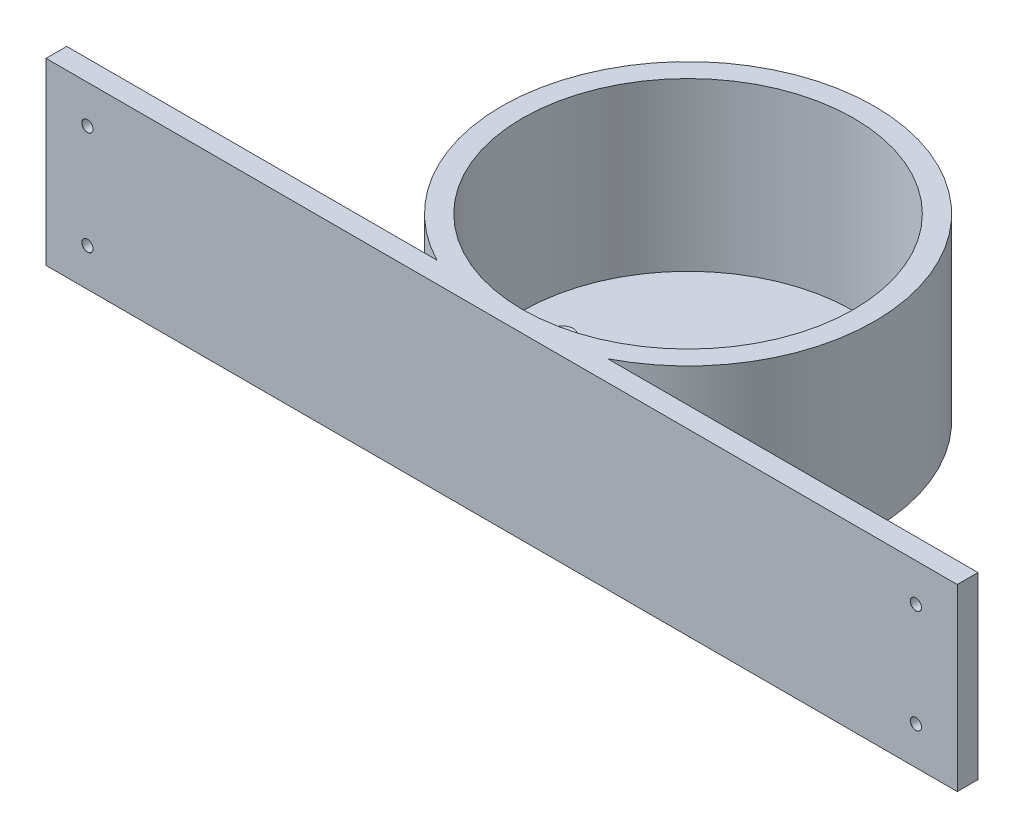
ISO-10303-21;
HEADER;
FILE_DESCRIPTION(('STEP AP214'),'2;1');
FILE_NAME('part.step','',(''),(''),'','','');
FILE_SCHEMA(('AUTOMOTIVE_DESIGN { 1 0 10303 214 1 1 1 1 }'));
ENDSEC;
DATA;
#1=APPLICATION_CONTEXT('core data for automotive mechanical design processes');
#2=APPLICATION_PROTOCOL_DEFINITION('international standard','automotive_design',2000,#1);
#3=PRODUCT_CONTEXT('',#1,'mechanical');
#4=PRODUCT('Part','Part','',(#3));
#5=PRODUCT_RELATED_PRODUCT_CATEGORY('part','',(#4));
#6=PRODUCT_DEFINITION_FORMATION('','',#4);
#7=PRODUCT_DEFINITION_CONTEXT('part definition',#1,'design');
#8=PRODUCT_DEFINITION('design','',#6,#7);
#9=PRODUCT_DEFINITION_SHAPE('','',#8);
#10=(LENGTH_UNIT() NAMED_UNIT(*) SI_UNIT(.MILLI.,.METRE.));
#11=(NAMED_UNIT(*) PLANE_ANGLE_UNIT() SI_UNIT($,.RADIAN.));
#12=(NAMED_UNIT(*) SI_UNIT($,.STERADIAN.) SOLID_ANGLE_UNIT());
#13=UNCERTAINTY_MEASURE_WITH_UNIT(LENGTH_MEASURE(1.E-05),#10,'distance_accuracy_value','');
#14=(GEOMETRIC_REPRESENTATION_CONTEXT(3) GLOBAL_UNCERTAINTY_ASSIGNED_CONTEXT((#13)) GLOBAL_UNIT_ASSIGNED_CONTEXT((#10,
#11,#12)) REPRESENTATION_CONTEXT('',''));
#15=CARTESIAN_POINT('',(0.,0.,0.));
#16=DIRECTION('',(0.,0.,1.));
#17=DIRECTION('',(1.,0.,0.));
#18=AXIS2_PLACEMENT_3D('',#15,#16,#17);
#19=CARTESIAN_POINT('',(0.,3.81,0.));
#20=DIRECTION('',(0.,-1.,0.));
#21=DIRECTION('',(0.,0.,-1.));
#22=AXIS2_PLACEMENT_3D('',#19,#20,#21);
#23=CYLINDRICAL_SURFACE('',#22,57.15);
#24=CARTESIAN_POINT('',(0.,54.991,0.));
#25=DIRECTION('',(0.,1.,0.));
#26=DIRECTION('',(0.,0.,1.));
#27=AXIS2_PLACEMENT_3D('',#24,#25,#26);
#28=CIRCLE('',#27,57.15);
#29=CARTESIAN_POINT('',(26.1817207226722,54.991,50.8));
#30=VERTEX_POINT('',#29);
#31=CARTESIAN_POINT('',(-26.1817207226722,54.991,50.8));
#32=VERTEX_POINT('',#31);
#33=EDGE_CURVE('E214',#30,#32,#28,.T.);
#34=ORIENTED_EDGE('',*,*,#33,.F.);
#35=DIRECTION('',(0.,-1.,0.));
#36=VECTOR('',#35,1.);
#37=CARTESIAN_POINT('',(26.1817207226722,3.81,50.8));
#38=LINE('',#37,#36);
#39=CARTESIAN_POINT('',(26.1817207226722,0.,50.8));
#40=VERTEX_POINT('',#39);
#41=EDGE_CURVE('E162',#30,#40,#38,.T.);
#42=ORIENTED_EDGE('',*,*,#41,.T.);
#43=CARTESIAN_POINT('',(0.,0.,0.));
#44=DIRECTION('',(0.,1.,0.));
#45=DIRECTION('',(0.,0.,1.));
#46=AXIS2_PLACEMENT_3D('',#43,#44,#45);
#47=CIRCLE('',#46,57.15);
#48=CARTESIAN_POINT('',(-26.1817207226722,0.,50.8));
#49=VERTEX_POINT('',#48);
#50=EDGE_CURVE('E217',#40,#49,#47,.T.);
#51=ORIENTED_EDGE('',*,*,#50,.T.);
#52=DIRECTION('',(0.,-1.,0.));
#53=VECTOR('',#52,1.);
#54=CARTESIAN_POINT('',(-26.1817207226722,3.81,50.8));
#55=LINE('',#54,#53);
#56=EDGE_CURVE('E157',#49,#32,#55,.F.);
#57=ORIENTED_EDGE('',*,*,#56,.T.);
#58=EDGE_LOOP('',(#34,#42,#51,#57));
#59=FACE_BOUND('',#58,.T.);
#60=ADVANCED_FACE('F39',(#59),#23,.T.);
#61=CARTESIAN_POINT('',(0.,0.,0.));
#62=DIRECTION('',(0.,1.,0.));
#63=DIRECTION('',(0.,0.,1.));
#64=AXIS2_PLACEMENT_3D('',#61,#62,#63);
#65=PLANE('',#64);
#66=CARTESIAN_POINT('',(38.354,0.,0.));
#67=DIRECTION('',(0.,1.,0.));
#68=DIRECTION('',(0.,0.,1.));
#69=AXIS2_PLACEMENT_3D('',#66,#67,#68);
#70=CIRCLE('',#69,1.725);
#71=CARTESIAN_POINT('',(38.354,0.,1.72499999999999));
#72=VERTEX_POINT('',#71);
#73=EDGE_CURVE('E165',#72,#72,#70,.T.);
#74=ORIENTED_EDGE('',*,*,#73,.T.);
#75=EDGE_LOOP('',(#74));
#76=FACE_BOUND('',#75,.T.);
#77=CARTESIAN_POINT('',(-38.354,0.,0.));
#78=DIRECTION('',(0.,1.,0.));
#79=DIRECTION('',(0.,0.,1.));
#80=AXIS2_PLACEMENT_3D('',#77,#78,#79);
#81=CIRCLE('',#80,1.725);
#82=CARTESIAN_POINT('',(-38.354,0.,1.725));
#83=VERTEX_POINT('',#82);
#84=EDGE_CURVE('E177',#83,#83,#81,.T.);
#85=ORIENTED_EDGE('',*,*,#84,.T.);
#86=EDGE_LOOP('',(#85));
#87=FACE_BOUND('',#86,.T.);
#88=DIRECTION('',(1.,0.,0.));
#89=VECTOR('',#88,1.);
#90=CARTESIAN_POINT('',(0.,0.,5.588));
#91=LINE('',#90,#89);
#92=CARTESIAN_POINT('',(-6.604,0.,5.588));
#93=VERTEX_POINT('',#92);
#94=CARTESIAN_POINT('',(6.604,0.,5.588));
#95=VERTEX_POINT('',#94);
#96=EDGE_CURVE('E192',#93,#95,#91,.T.);
#97=ORIENTED_EDGE('',*,*,#96,.T.);
#98=DIRECTION('',(0.,0.,-1.));
#99=VECTOR('',#98,1.);
#100=CARTESIAN_POINT('',(6.604,0.,0.));
#101=LINE('',#100,#99);
#102=CARTESIAN_POINT('',(6.604,0.,-5.588));
#103=VERTEX_POINT('',#102);
#104=EDGE_CURVE('E208',#95,#103,#101,.T.);
#105=ORIENTED_EDGE('',*,*,#104,.T.);
#106=DIRECTION('',(-1.,0.,0.));
#107=VECTOR('',#106,1.);
#108=CARTESIAN_POINT('',(0.,0.,-5.588));
#109=LINE('',#108,#107);
#110=CARTESIAN_POINT('',(-6.604,0.,-5.588));
#111=VERTEX_POINT('',#110);
#112=EDGE_CURVE('E205',#103,#111,#109,.T.);
#113=ORIENTED_EDGE('',*,*,#112,.T.);
#114=DIRECTION('',(0.,0.,1.));
#115=VECTOR('',#114,1.);
#116=CARTESIAN_POINT('',(-6.604,0.,0.));
#117=LINE('',#116,#115);
#118=EDGE_CURVE('E202',#111,#93,#117,.T.);
#119=ORIENTED_EDGE('',*,*,#118,.T.);
#120=EDGE_LOOP('',(#97,#105,#113,#119));
#121=FACE_BOUND('',#120,.T.);
#122=ORIENTED_EDGE('',*,*,#50,.F.);
#123=DIRECTION('',(-1.,0.,0.));
#124=VECTOR('',#123,1.);
#125=CARTESIAN_POINT('',(139.7,0.,50.8));
#126=LINE('',#125,#124);
#127=CARTESIAN_POINT('',(139.7,0.,50.8));
#128=VERTEX_POINT('',#127);
#129=EDGE_CURVE('E121',#128,#40,#126,.T.);
#130=ORIENTED_EDGE('',*,*,#129,.F.);
#131=DIRECTION('',(0.,0.,-1.));
#132=VECTOR('',#131,1.);
#133=CARTESIAN_POINT('',(139.7,0.,57.15));
#134=LINE('',#133,#132);
#135=CARTESIAN_POINT('',(139.7,0.,57.15));
#136=VERTEX_POINT('',#135);
#137=EDGE_CURVE('E114',#136,#128,#134,.T.);
#138=ORIENTED_EDGE('',*,*,#137,.F.);
#139=DIRECTION('',(-1.,0.,0.));
#140=VECTOR('',#139,1.);
#141=CARTESIAN_POINT('',(139.7,0.,57.15));
#142=LINE('',#141,#140);
#143=CARTESIAN_POINT('',(-139.7,0.,57.15));
#144=VERTEX_POINT('',#143);
#145=EDGE_CURVE('E119',#136,#144,#142,.T.);
#146=ORIENTED_EDGE('',*,*,#145,.T.);
#147=DIRECTION('',(0.,0.,-1.));
#148=VECTOR('',#147,1.);
#149=CARTESIAN_POINT('',(-139.7,0.,57.15));
#150=LINE('',#149,#148);
#151=CARTESIAN_POINT('',(-139.7,0.,50.8));
#152=VERTEX_POINT('',#151);
#153=EDGE_CURVE('E126',#144,#152,#150,.T.);
#154=ORIENTED_EDGE('',*,*,#153,.T.);
#155=EDGE_CURVE('E152',#49,#152,#126,.T.);
#156=ORIENTED_EDGE('',*,*,#155,.F.);
#157=EDGE_LOOP('',(#122,#130,#138,#146,#154,#156));
#158=FACE_BOUND('',#157,.T.);
#159=ADVANCED_FACE('F117',(#76,#87,#121,#158),#65,.F.);
#160=CARTESIAN_POINT('',(0.,54.991,0.));
#161=DIRECTION('',(0.,1.,0.));
#162=DIRECTION('',(0.,0.,1.));
#163=AXIS2_PLACEMENT_3D('',#160,#161,#162);
#164=PLANE('',#163);
#165=CARTESIAN_POINT('',(0.,54.991,0.));
#166=DIRECTION('',(0.,1.,0.));
#167=DIRECTION('',(0.,0.,1.));
#168=AXIS2_PLACEMENT_3D('',#165,#166,#167);
#169=CIRCLE('',#168,50.8);
#170=CARTESIAN_POINT('',(0.,54.991,-50.8));
#171=VERTEX_POINT('',#170);
#172=EDGE_CURVE('E211',#171,#171,#169,.T.);
#173=ORIENTED_EDGE('',*,*,#172,.F.);
#174=EDGE_LOOP('',(#173));
#175=FACE_BOUND('',#174,.T.);
#176=DIRECTION('',(0.,0.,-1.));
#177=VECTOR('',#176,1.);
#178=CARTESIAN_POINT('',(-139.7,54.991,57.15));
#179=LINE('',#178,#177);
#180=CARTESIAN_POINT('',(-139.7,54.991,57.15));
#181=VERTEX_POINT('',#180);
#182=CARTESIAN_POINT('',(-139.7,54.991,50.8));
#183=VERTEX_POINT('',#182);
#184=EDGE_CURVE('E158',#181,#183,#179,.T.);
#185=ORIENTED_EDGE('',*,*,#184,.F.);
#186=DIRECTION('',(1.,0.,0.));
#187=VECTOR('',#186,1.);
#188=CARTESIAN_POINT('',(-139.7,54.991,57.15));
#189=LINE('',#188,#187);
#190=CARTESIAN_POINT('',(139.7,54.991,57.15));
#191=VERTEX_POINT('',#190);
#192=EDGE_CURVE('E127',#181,#191,#189,.T.);
#193=ORIENTED_EDGE('',*,*,#192,.T.);
#194=DIRECTION('',(0.,0.,-1.));
#195=VECTOR('',#194,1.);
#196=CARTESIAN_POINT('',(139.7,54.991,57.15));
#197=LINE('',#196,#195);
#198=CARTESIAN_POINT('',(139.7,54.991,50.8));
#199=VERTEX_POINT('',#198);
#200=EDGE_CURVE('E140',#191,#199,#197,.T.);
#201=ORIENTED_EDGE('',*,*,#200,.T.);
#202=DIRECTION('',(1.,0.,0.));
#203=VECTOR('',#202,1.);
#204=CARTESIAN_POINT('',(-139.7,54.991,50.8));
#205=LINE('',#204,#203);
#206=EDGE_CURVE('E142',#30,#199,#205,.T.);
#207=ORIENTED_EDGE('',*,*,#206,.F.);
#208=ORIENTED_EDGE('',*,*,#33,.T.);
#209=EDGE_CURVE('E53',#183,#32,#205,.T.);
#210=ORIENTED_EDGE('',*,*,#209,.F.);
#211=EDGE_LOOP('',(#185,#193,#201,#207,#208,#210));
#212=FACE_BOUND('',#211,.T.);
#213=ADVANCED_FACE('F245',(#175,#212),#164,.T.);
#214=CARTESIAN_POINT('',(0.,54.991,0.));
#215=DIRECTION('',(0.,-1.,0.));
#216=DIRECTION('',(0.,0.,-1.));
#217=AXIS2_PLACEMENT_3D('',#214,#215,#216);
#218=CYLINDRICAL_SURFACE('',#217,50.8);
#219=CARTESIAN_POINT('',(0.,3.81,0.));
#220=DIRECTION('',(0.,1.,0.));
#221=DIRECTION('',(0.,0.,1.));
#222=AXIS2_PLACEMENT_3D('',#219,#220,#221);
#223=CIRCLE('',#222,50.8);
#224=CARTESIAN_POINT('',(0.,3.80999999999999,-50.8));
#225=VERTEX_POINT('',#224);
#226=EDGE_CURVE('E220',#225,#225,#223,.F.);
#227=CARTESIAN_POINT('',(0.,3.80999999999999,-50.8));
#228=CARTESIAN_POINT('',(0.,4.34313541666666,-50.8));
#229=CARTESIAN_POINT('',(0.,4.87627083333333,-50.8));
#230=CARTESIAN_POINT('',(0.,5.94254166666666,-50.8));
#231=CARTESIAN_POINT('',(0.,6.47567708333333,-50.8));
#232=CARTESIAN_POINT('',(0.,7.54194791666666,-50.8));
#233=CARTESIAN_POINT('',(0.,8.07508333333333,-50.8));
#234=CARTESIAN_POINT('',(0.,9.14135416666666,-50.8));
#235=CARTESIAN_POINT('',(0.,9.67448958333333,-50.8));
#236=CARTESIAN_POINT('',(0.,10.7407604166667,-50.8));
#237=CARTESIAN_POINT('',(0.,11.2738958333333,-50.8));
#238=CARTESIAN_POINT('',(0.,12.3401666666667,-50.8));
#239=CARTESIAN_POINT('',(0.,12.8733020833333,-50.8));
#240=CARTESIAN_POINT('',(0.,13.9395729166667,-50.8));
#241=CARTESIAN_POINT('',(0.,14.4727083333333,-50.8));
#242=CARTESIAN_POINT('',(0.,15.5389791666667,-50.8));
#243=CARTESIAN_POINT('',(0.,16.0721145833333,-50.8));
#244=CARTESIAN_POINT('',(0.,17.1383854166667,-50.8));
#245=CARTESIAN_POINT('',(0.,17.6715208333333,-50.8));
#246=CARTESIAN_POINT('',(0.,18.7377916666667,-50.8));
#247=CARTESIAN_POINT('',(0.,19.2709270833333,-50.8));
#248=CARTESIAN_POINT('',(0.,20.3371979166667,-50.8));
#249=CARTESIAN_POINT('',(0.,20.8703333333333,-50.8));
#250=CARTESIAN_POINT('',(0.,21.9366041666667,-50.8));
#251=CARTESIAN_POINT('',(0.,22.4697395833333,-50.8));
#252=CARTESIAN_POINT('',(0.,23.5360104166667,-50.8));
#253=CARTESIAN_POINT('',(0.,24.0691458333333,-50.8));
#254=CARTESIAN_POINT('',(0.,25.1354166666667,-50.8));
#255=CARTESIAN_POINT('',(0.,25.6685520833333,-50.8));
#256=CARTESIAN_POINT('',(0.,26.7348229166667,-50.8));
#257=CARTESIAN_POINT('',(0.,27.2679583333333,-50.8));
#258=CARTESIAN_POINT('',(0.,28.3342291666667,-50.8));
#259=CARTESIAN_POINT('',(0.,28.8673645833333,-50.8));
#260=CARTESIAN_POINT('',(0.,29.9336354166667,-50.8));
#261=CARTESIAN_POINT('',(0.,30.4667708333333,-50.8));
#262=CARTESIAN_POINT('',(0.,31.5330416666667,-50.8));
#263=CARTESIAN_POINT('',(0.,32.0661770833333,-50.8));
#264=CARTESIAN_POINT('',(0.,33.1324479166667,-50.8));
#265=CARTESIAN_POINT('',(0.,33.6655833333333,-50.8));
#266=CARTESIAN_POINT('',(0.,34.7318541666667,-50.8));
#267=CARTESIAN_POINT('',(0.,35.2649895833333,-50.8));
#268=CARTESIAN_POINT('',(0.,36.3312604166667,-50.8));
#269=CARTESIAN_POINT('',(0.,36.8643958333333,-50.8));
#270=CARTESIAN_POINT('',(0.,37.9306666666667,-50.8));
#271=CARTESIAN_POINT('',(0.,38.4638020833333,-50.8));
#272=CARTESIAN_POINT('',(0.,39.5300729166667,-50.8));
#273=CARTESIAN_POINT('',(0.,40.0632083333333,-50.8));
#274=CARTESIAN_POINT('',(0.,41.1294791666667,-50.8));
#275=CARTESIAN_POINT('',(0.,41.6626145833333,-50.8));
#276=CARTESIAN_POINT('',(0.,42.7288854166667,-50.8));
#277=CARTESIAN_POINT('',(0.,43.2620208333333,-50.8));
#278=CARTESIAN_POINT('',(0.,44.3282916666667,-50.8));
#279=CARTESIAN_POINT('',(0.,44.8614270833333,-50.8));
#280=CARTESIAN_POINT('',(0.,45.9276979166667,-50.8));
#281=CARTESIAN_POINT('',(0.,46.4608333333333,-50.8));
#282=CARTESIAN_POINT('',(0.,47.5271041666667,-50.8));
#283=CARTESIAN_POINT('',(0.,48.0602395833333,-50.8));
#284=CARTESIAN_POINT('',(0.,49.1265104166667,-50.8));
#285=CARTESIAN_POINT('',(0.,49.6596458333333,-50.8));
#286=CARTESIAN_POINT('',(0.,50.7259166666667,-50.8));
#287=CARTESIAN_POINT('',(0.,51.2590520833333,-50.8));
#288=CARTESIAN_POINT('',(0.,52.3253229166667,-50.8));
#289=CARTESIAN_POINT('',(0.,52.8584583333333,-50.8));
#290=CARTESIAN_POINT('',(0.,53.9247291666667,-50.8));
#291=CARTESIAN_POINT('',(0.,54.4578645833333,-50.8));
#292=CARTESIAN_POINT('',(0.,54.991,-50.8));
#293=B_SPLINE_CURVE_WITH_KNOTS('',3,(#227,#228,#229,#230,#231,#232,#233,#234,#235,#236,#237,
#238,#239,#240,#241,#242,#243,#244,#245,#246,#247,#248,#249,#250,#251,#252,#253,#254,#255,#256,
#257,#258,#259,#260,#261,#262,#263,#264,#265,#266,#267,#268,#269,#270,#271,#272,#273,#274,#275,
#276,#277,#278,#279,#280,#281,#282,#283,#284,#285,#286,#287,#288,#289,#290,#291,#292),
.UNSPECIFIED.,.F.,.F.,(4,2,2,2,2,2,2,2,2,2,2,2,2,2,2,2,2,2,2,2,2,2,2,2,2,2,2,2,2,2,2,2,4),(0.,
1.59940625,3.1988125,4.79821875,6.397625,7.99703125,9.5964375,11.19584375,12.79525,14.39465625,
15.9940625,17.59346875,19.192875,20.79228125,22.3916875,23.99109375,25.5905,27.18990625,
28.7893125,30.38871875,31.988125,33.58753125,35.1869375,36.78634375,38.38575,39.98515625,
41.5845625,43.18396875,44.783375,46.38278125,47.9821875,49.58159375,51.181),.UNSPECIFIED.);
#294=EDGE_CURVE('BSEAM251',#225,#171,#293,.T.);
#295=ORIENTED_EDGE('',*,*,#226,.T.);
#296=ORIENTED_EDGE('',*,*,#172,.T.);
#297=ORIENTED_EDGE('',*,*,#294,.T.);
#298=ORIENTED_EDGE('',*,*,#294,.F.);
#299=EDGE_LOOP('',(#295,#297,#296,#298));
#300=FACE_BOUND('',#299,.T.);
#301=ADVANCED_FACE('F251',(#300),#218,.F.);
#302=CARTESIAN_POINT('',(0.,3.81,0.));
#303=DIRECTION('',(0.,1.,0.));
#304=DIRECTION('',(0.,0.,1.));
#305=AXIS2_PLACEMENT_3D('',#302,#303,#304);
#306=PLANE('',#305);
#307=CARTESIAN_POINT('',(38.354,3.81,0.));
#308=DIRECTION('',(0.,1.,0.));
#309=DIRECTION('',(0.,0.,1.));
#310=AXIS2_PLACEMENT_3D('',#307,#308,#309);
#311=CIRCLE('',#310,3.15);
#312=CARTESIAN_POINT('',(38.354,3.81,3.14999999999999));
#313=VERTEX_POINT('',#312);
#314=EDGE_CURVE('E168',#313,#313,#311,.T.);
#315=ORIENTED_EDGE('',*,*,#314,.F.);
#316=EDGE_LOOP('',(#315));
#317=FACE_BOUND('',#316,.T.);
#318=CARTESIAN_POINT('',(-38.354,3.81,0.));
#319=DIRECTION('',(0.,1.,0.));
#320=DIRECTION('',(0.,0.,1.));
#321=AXIS2_PLACEMENT_3D('',#318,#319,#320);
#322=CIRCLE('',#321,3.15);
#323=CARTESIAN_POINT('',(-38.354,3.81,3.15));
#324=VERTEX_POINT('',#323);
#325=EDGE_CURVE('E180',#324,#324,#322,.T.);
#326=ORIENTED_EDGE('',*,*,#325,.F.);
#327=EDGE_LOOP('',(#326));
#328=FACE_BOUND('',#327,.T.);
#329=DIRECTION('',(0.,0.,-1.));
#330=VECTOR('',#329,1.);
#331=CARTESIAN_POINT('',(6.604,3.81,0.));
#332=LINE('',#331,#330);
#333=CARTESIAN_POINT('',(6.604,3.81,5.588));
#334=VERTEX_POINT('',#333);
#335=CARTESIAN_POINT('',(6.604,3.81,-5.588));
#336=VERTEX_POINT('',#335);
#337=EDGE_CURVE('E11',#334,#336,#332,.T.);
#338=ORIENTED_EDGE('',*,*,#337,.F.);
#339=DIRECTION('',(1.,0.,0.));
#340=VECTOR('',#339,1.);
#341=CARTESIAN_POINT('',(0.,3.81,5.588));
#342=LINE('',#341,#340);
#343=CARTESIAN_POINT('',(-6.604,3.81,5.588));
#344=VERTEX_POINT('',#343);
#345=EDGE_CURVE('E223',#344,#334,#342,.T.);
#346=ORIENTED_EDGE('',*,*,#345,.F.);
#347=DIRECTION('',(0.,0.,1.));
#348=VECTOR('',#347,1.);
#349=CARTESIAN_POINT('',(-6.604,3.81,0.));
#350=LINE('',#349,#348);
#351=CARTESIAN_POINT('',(-6.604,3.81,-5.588));
#352=VERTEX_POINT('',#351);
#353=EDGE_CURVE('E225',#352,#344,#350,.T.);
#354=ORIENTED_EDGE('',*,*,#353,.F.);
#355=DIRECTION('',(-1.,0.,0.));
#356=VECTOR('',#355,1.);
#357=CARTESIAN_POINT('',(0.,3.81,-5.588));
#358=LINE('',#357,#356);
#359=EDGE_CURVE('E46',#336,#352,#358,.T.);
#360=ORIENTED_EDGE('',*,*,#359,.F.);
#361=EDGE_LOOP('',(#338,#346,#354,#360));
#362=FACE_BOUND('',#361,.T.);
#363=ORIENTED_EDGE('',*,*,#226,.F.);
#364=EDGE_LOOP('',(#363));
#365=FACE_BOUND('',#364,.T.);
#366=ADVANCED_FACE('F238',(#317,#328,#362,#365),#306,.T.);
#367=CARTESIAN_POINT('',(6.604,54.991,5.588));
#368=DIRECTION('',(1.,0.,0.));
#369=DIRECTION('',(0.,0.,-1.));
#370=AXIS2_PLACEMENT_3D('',#367,#368,#369);
#371=PLANE('',#370);
#372=DIRECTION('',(0.,-1.,0.));
#373=VECTOR('',#372,1.);
#374=CARTESIAN_POINT('',(6.604,54.991,5.588));
#375=LINE('',#374,#373);
#376=EDGE_CURVE('E61',#334,#95,#375,.T.);
#377=ORIENTED_EDGE('',*,*,#376,.F.);
#378=ORIENTED_EDGE('',*,*,#337,.T.);
#379=DIRECTION('',(0.,-1.,0.));
#380=VECTOR('',#379,1.);
#381=CARTESIAN_POINT('',(6.604,54.991,-5.588));
#382=LINE('',#381,#380);
#383=EDGE_CURVE('E189',#336,#103,#382,.T.);
#384=ORIENTED_EDGE('',*,*,#383,.T.);
#385=ORIENTED_EDGE('',*,*,#104,.F.);
#386=EDGE_LOOP('',(#377,#378,#384,#385));
#387=FACE_BOUND('',#386,.T.);
#388=ADVANCED_FACE('F242',(#387),#371,.F.);
#389=CARTESIAN_POINT('',(-6.604,54.991,-5.588));
#390=DIRECTION('',(0.,0.,-1.));
#391=DIRECTION('',(-1.,0.,0.));
#392=AXIS2_PLACEMENT_3D('',#389,#390,#391);
#393=PLANE('',#392);
#394=ORIENTED_EDGE('',*,*,#383,.F.);
#395=ORIENTED_EDGE('',*,*,#359,.T.);
#396=DIRECTION('',(0.,-1.,0.));
#397=VECTOR('',#396,1.);
#398=CARTESIAN_POINT('',(-6.604,54.991,-5.588));
#399=LINE('',#398,#397);
#400=EDGE_CURVE('E193',#352,#111,#399,.T.);
#401=ORIENTED_EDGE('',*,*,#400,.T.);
#402=ORIENTED_EDGE('',*,*,#112,.F.);
#403=EDGE_LOOP('',(#394,#395,#401,#402));
#404=FACE_BOUND('',#403,.T.);
#405=ADVANCED_FACE('F231',(#404),#393,.F.);
#406=CARTESIAN_POINT('',(-6.604,54.991,5.588));
#407=DIRECTION('',(-1.,0.,0.));
#408=DIRECTION('',(0.,0.,1.));
#409=AXIS2_PLACEMENT_3D('',#406,#407,#408);
#410=PLANE('',#409);
#411=ORIENTED_EDGE('',*,*,#400,.F.);
#412=ORIENTED_EDGE('',*,*,#353,.T.);
#413=DIRECTION('',(0.,-1.,0.));
#414=VECTOR('',#413,1.);
#415=CARTESIAN_POINT('',(-6.604,54.991,5.588));
#416=LINE('',#415,#414);
#417=EDGE_CURVE('E196',#344,#93,#416,.T.);
#418=ORIENTED_EDGE('',*,*,#417,.T.);
#419=ORIENTED_EDGE('',*,*,#118,.F.);
#420=EDGE_LOOP('',(#411,#412,#418,#419));
#421=FACE_BOUND('',#420,.T.);
#422=ADVANCED_FACE('F236',(#421),#410,.F.);
#423=CARTESIAN_POINT('',(-6.604,54.991,5.588));
#424=DIRECTION('',(0.,0.,1.));
#425=DIRECTION('',(1.,0.,0.));
#426=AXIS2_PLACEMENT_3D('',#423,#424,#425);
#427=PLANE('',#426);
#428=ORIENTED_EDGE('',*,*,#417,.F.);
#429=ORIENTED_EDGE('',*,*,#345,.T.);
#430=ORIENTED_EDGE('',*,*,#376,.T.);
#431=ORIENTED_EDGE('',*,*,#96,.F.);
#432=EDGE_LOOP('',(#428,#429,#430,#431));
#433=FACE_BOUND('',#432,.T.);
#434=ADVANCED_FACE('F240',(#433),#427,.F.);
#435=CARTESIAN_POINT('',(-38.354,0.0250000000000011,0.));
#436=DIRECTION('',(0.,-1.,0.));
#437=DIRECTION('',(0.,0.,-1.));
#438=AXIS2_PLACEMENT_3D('',#435,#436,#437);
#439=CONICAL_SURFACE('',#438,1.7,0.785398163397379);
#440=ORIENTED_EDGE('',*,*,#84,.F.);
#441=EDGE_LOOP('',(#440));
#442=FACE_BOUND('',#441,.T.);
#443=CARTESIAN_POINT('',(-38.354,0.0250000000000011,0.));
#444=DIRECTION('',(0.,1.,0.));
#445=DIRECTION('',(0.,0.,1.));
#446=AXIS2_PLACEMENT_3D('',#443,#444,#445);
#447=CIRCLE('',#446,1.7);
#448=CARTESIAN_POINT('',(-38.354,0.0250000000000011,1.7));
#449=VERTEX_POINT('',#448);
#450=EDGE_CURVE('E186',#449,#449,#447,.T.);
#451=ORIENTED_EDGE('',*,*,#450,.T.);
#452=EDGE_LOOP('',(#451));
#453=FACE_BOUND('',#452,.T.);
#454=ADVANCED_FACE('F267',(#442,#453),#439,.F.);
#455=CARTESIAN_POINT('',(-38.354,3.81,0.));
#456=DIRECTION('',(0.,1.,0.));
#457=DIRECTION('',(0.,0.,1.));
#458=AXIS2_PLACEMENT_3D('',#455,#456,#457);
#459=CYLINDRICAL_SURFACE('',#458,1.7);
#460=ORIENTED_EDGE('',*,*,#450,.F.);
#461=EDGE_LOOP('',(#460));
#462=FACE_BOUND('',#461,.T.);
#463=CARTESIAN_POINT('',(-38.354,2.36,0.));
#464=DIRECTION('',(0.,1.,0.));
#465=DIRECTION('',(0.,0.,1.));
#466=AXIS2_PLACEMENT_3D('',#463,#464,#465);
#467=CIRCLE('',#466,1.7);
#468=CARTESIAN_POINT('',(-38.354,2.36,1.7));
#469=VERTEX_POINT('',#468);
#470=EDGE_CURVE('E183',#469,#469,#467,.T.);
#471=ORIENTED_EDGE('',*,*,#470,.T.);
#472=EDGE_LOOP('',(#471));
#473=FACE_BOUND('',#472,.T.);
#474=ADVANCED_FACE('F274',(#462,#473),#459,.F.);
#475=CARTESIAN_POINT('',(-38.354,3.81,0.));
#476=DIRECTION('',(0.,1.,0.));
#477=DIRECTION('',(0.,0.,1.));
#478=AXIS2_PLACEMENT_3D('',#475,#476,#477);
#479=CONICAL_SURFACE('',#478,3.15,0.785398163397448);
#480=ORIENTED_EDGE('',*,*,#470,.F.);
#481=EDGE_LOOP('',(#480));
#482=FACE_BOUND('',#481,.T.);
#483=ORIENTED_EDGE('',*,*,#325,.T.);
#484=EDGE_LOOP('',(#483));
#485=FACE_BOUND('',#484,.T.);
#486=ADVANCED_FACE('F278',(#482,#485),#479,.F.);
#487=CARTESIAN_POINT('',(38.354,0.0250000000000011,0.));
#488=DIRECTION('',(0.,-1.,0.));
#489=DIRECTION('',(0.,0.,-1.));
#490=AXIS2_PLACEMENT_3D('',#487,#488,#489);
#491=CONICAL_SURFACE('',#490,1.7,0.785398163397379);
#492=ORIENTED_EDGE('',*,*,#73,.F.);
#493=EDGE_LOOP('',(#492));
#494=FACE_BOUND('',#493,.T.);
#495=CARTESIAN_POINT('',(38.354,0.0250000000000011,0.));
#496=DIRECTION('',(0.,1.,0.));
#497=DIRECTION('',(0.,0.,1.));
#498=AXIS2_PLACEMENT_3D('',#495,#496,#497);
#499=CIRCLE('',#498,1.7);
#500=CARTESIAN_POINT('',(38.354,0.0250000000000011,1.69999999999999));
#501=VERTEX_POINT('',#500);
#502=EDGE_CURVE('E174',#501,#501,#499,.T.);
#503=ORIENTED_EDGE('',*,*,#502,.T.);
#504=EDGE_LOOP('',(#503));
#505=FACE_BOUND('',#504,.T.);
#506=ADVANCED_FACE('F282',(#494,#505),#491,.F.);
#507=CARTESIAN_POINT('',(38.354,3.81,0.));
#508=DIRECTION('',(0.,1.,0.));
#509=DIRECTION('',(0.,0.,1.));
#510=AXIS2_PLACEMENT_3D('',#507,#508,#509);
#511=CYLINDRICAL_SURFACE('',#510,1.7);
#512=ORIENTED_EDGE('',*,*,#502,.F.);
#513=EDGE_LOOP('',(#512));
#514=FACE_BOUND('',#513,.T.);
#515=CARTESIAN_POINT('',(38.354,2.36,0.));
#516=DIRECTION('',(0.,1.,0.));
#517=DIRECTION('',(0.,0.,1.));
#518=AXIS2_PLACEMENT_3D('',#515,#516,#517);
#519=CIRCLE('',#518,1.7);
#520=CARTESIAN_POINT('',(38.354,2.36,1.69999999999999));
#521=VERTEX_POINT('',#520);
#522=EDGE_CURVE('E171',#521,#521,#519,.T.);
#523=ORIENTED_EDGE('',*,*,#522,.T.);
#524=EDGE_LOOP('',(#523));
#525=FACE_BOUND('',#524,.T.);
#526=ADVANCED_FACE('F286',(#514,#525),#511,.F.);
#527=CARTESIAN_POINT('',(38.354,3.81,0.));
#528=DIRECTION('',(0.,1.,0.));
#529=DIRECTION('',(0.,0.,1.));
#530=AXIS2_PLACEMENT_3D('',#527,#528,#529);
#531=CONICAL_SURFACE('',#530,3.15,0.785398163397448);
#532=ORIENTED_EDGE('',*,*,#522,.F.);
#533=EDGE_LOOP('',(#532));
#534=FACE_BOUND('',#533,.T.);
#535=ORIENTED_EDGE('',*,*,#314,.T.);
#536=EDGE_LOOP('',(#535));
#537=FACE_BOUND('',#536,.T.);
#538=ADVANCED_FACE('F290',(#534,#537),#531,.F.);
#539=CARTESIAN_POINT('',(0.,0.,57.15));
#540=DIRECTION('',(0.,0.,-1.));
#541=DIRECTION('',(-1.,0.,0.));
#542=AXIS2_PLACEMENT_3D('',#539,#540,#541);
#543=PLANE('',#542);
#544=CARTESIAN_POINT('',(127.,43.3704999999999,57.15));
#545=DIRECTION('',(0.,0.,-1.));
#546=DIRECTION('',(-1.,0.,0.));
#547=AXIS2_PLACEMENT_3D('',#544,#545,#546);
#548=CIRCLE('',#547,1.725);
#549=CARTESIAN_POINT('',(125.275,43.3704999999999,57.15));
#550=VERTEX_POINT('',#549);
#551=EDGE_CURVE('E365',#550,#550,#548,.T.);
#552=ORIENTED_EDGE('',*,*,#551,.T.);
#553=EDGE_LOOP('',(#552));
#554=FACE_BOUND('',#553,.T.);
#555=CARTESIAN_POINT('',(127.,11.6205,57.15));
#556=DIRECTION('',(0.,0.,-1.));
#557=DIRECTION('',(-1.,0.,0.));
#558=AXIS2_PLACEMENT_3D('',#555,#556,#557);
#559=CIRCLE('',#558,1.725);
#560=CARTESIAN_POINT('',(125.275,11.6205,57.15));
#561=VERTEX_POINT('',#560);
#562=EDGE_CURVE('E374',#561,#561,#559,.T.);
#563=ORIENTED_EDGE('',*,*,#562,.T.);
#564=EDGE_LOOP('',(#563));
#565=FACE_BOUND('',#564,.T.);
#566=CARTESIAN_POINT('',(-127.,43.3705,57.15));
#567=DIRECTION('',(0.,0.,-1.));
#568=DIRECTION('',(-1.,0.,0.));
#569=AXIS2_PLACEMENT_3D('',#566,#567,#568);
#570=CIRCLE('',#569,1.725);
#571=CARTESIAN_POINT('',(-128.725,43.3705,57.15));
#572=VERTEX_POINT('',#571);
#573=EDGE_CURVE('E386',#572,#572,#570,.T.);
#574=ORIENTED_EDGE('',*,*,#573,.T.);
#575=EDGE_LOOP('',(#574));
#576=FACE_BOUND('',#575,.T.);
#577=CARTESIAN_POINT('',(-127.,11.6205,57.15));
#578=DIRECTION('',(0.,0.,-1.));
#579=DIRECTION('',(-1.,0.,0.));
#580=AXIS2_PLACEMENT_3D('',#577,#578,#579);
#581=CIRCLE('',#580,1.725);
#582=CARTESIAN_POINT('',(-128.725,11.6205,57.15));
#583=VERTEX_POINT('',#582);
#584=EDGE_CURVE('E398',#583,#583,#581,.T.);
#585=ORIENTED_EDGE('',*,*,#584,.T.);
#586=EDGE_LOOP('',(#585));
#587=FACE_BOUND('',#586,.T.);
#588=ORIENTED_EDGE('',*,*,#192,.F.);
#589=DIRECTION('',(0.,1.,0.));
#590=VECTOR('',#589,1.);
#591=CARTESIAN_POINT('',(-139.7,0.,57.15));
#592=LINE('',#591,#590);
#593=EDGE_CURVE('E135',#144,#181,#592,.T.);
#594=ORIENTED_EDGE('',*,*,#593,.F.);
#595=ORIENTED_EDGE('',*,*,#145,.F.);
#596=DIRECTION('',(0.,-1.,0.));
#597=VECTOR('',#596,1.);
#598=CARTESIAN_POINT('',(139.7,54.991,57.15));
#599=LINE('',#598,#597);
#600=EDGE_CURVE('E133',#191,#136,#599,.T.);
#601=ORIENTED_EDGE('',*,*,#600,.F.);
#602=EDGE_LOOP('',(#588,#594,#595,#601));
#603=FACE_BOUND('',#602,.T.);
#604=ADVANCED_FACE('F132',(#554,#565,#576,#587,#603),#543,.F.);
#605=CARTESIAN_POINT('',(0.,0.,50.8));
#606=DIRECTION('',(0.,0.,-1.));
#607=DIRECTION('',(-1.,0.,0.));
#608=AXIS2_PLACEMENT_3D('',#605,#606,#607);
#609=PLANE('',#608);
#610=CARTESIAN_POINT('',(127.,43.3704999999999,50.8));
#611=DIRECTION('',(0.,0.,-1.));
#612=DIRECTION('',(-1.,0.,0.));
#613=AXIS2_PLACEMENT_3D('',#610,#611,#612);
#614=CIRCLE('',#613,3.14999999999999);
#615=CARTESIAN_POINT('',(123.85,43.3704999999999,50.8));
#616=VERTEX_POINT('',#615);
#617=EDGE_CURVE('E364',#616,#616,#614,.T.);
#618=ORIENTED_EDGE('',*,*,#617,.F.);
#619=EDGE_LOOP('',(#618));
#620=FACE_BOUND('',#619,.T.);
#621=CARTESIAN_POINT('',(127.,11.6205,50.8));
#622=DIRECTION('',(0.,0.,-1.));
#623=DIRECTION('',(-1.,0.,0.));
#624=AXIS2_PLACEMENT_3D('',#621,#622,#623);
#625=CIRCLE('',#624,3.14999999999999);
#626=CARTESIAN_POINT('',(123.85,11.6205,50.8));
#627=VERTEX_POINT('',#626);
#628=EDGE_CURVE('E377',#627,#627,#625,.T.);
#629=ORIENTED_EDGE('',*,*,#628,.F.);
#630=EDGE_LOOP('',(#629));
#631=FACE_BOUND('',#630,.T.);
#632=ORIENTED_EDGE('',*,*,#41,.F.);
#633=ORIENTED_EDGE('',*,*,#206,.T.);
#634=DIRECTION('',(0.,-1.,0.));
#635=VECTOR('',#634,1.);
#636=CARTESIAN_POINT('',(139.7,54.991,50.8));
#637=LINE('',#636,#635);
#638=EDGE_CURVE('E150',#199,#128,#637,.T.);
#639=ORIENTED_EDGE('',*,*,#638,.T.);
#640=ORIENTED_EDGE('',*,*,#129,.T.);
#641=EDGE_LOOP('',(#632,#633,#639,#640));
#642=FACE_BOUND('',#641,.T.);
#643=ADVANCED_FACE('F303',(#620,#631,#642),#609,.T.);
#644=CARTESIAN_POINT('',(-127.,43.3705,50.8));
#645=DIRECTION('',(0.,0.,-1.));
#646=DIRECTION('',(-1.,0.,0.));
#647=AXIS2_PLACEMENT_3D('',#644,#645,#646);
#648=CIRCLE('',#647,3.15);
#649=CARTESIAN_POINT('',(-130.15,43.3705,50.8));
#650=VERTEX_POINT('',#649);
#651=EDGE_CURVE('E389',#650,#650,#648,.T.);
#652=ORIENTED_EDGE('',*,*,#651,.F.);
#653=EDGE_LOOP('',(#652));
#654=FACE_BOUND('',#653,.T.);
#655=CARTESIAN_POINT('',(-127.,11.6205,50.8));
#656=DIRECTION('',(0.,0.,-1.));
#657=DIRECTION('',(-1.,0.,0.));
#658=AXIS2_PLACEMENT_3D('',#655,#656,#657);
#659=CIRCLE('',#658,3.15);
#660=CARTESIAN_POINT('',(-130.15,11.6205,50.8));
#661=VERTEX_POINT('',#660);
#662=EDGE_CURVE('E401',#661,#661,#659,.T.);
#663=ORIENTED_EDGE('',*,*,#662,.F.);
#664=EDGE_LOOP('',(#663));
#665=FACE_BOUND('',#664,.T.);
#666=ORIENTED_EDGE('',*,*,#56,.F.);
#667=ORIENTED_EDGE('',*,*,#155,.T.);
#668=DIRECTION('',(0.,1.,0.));
#669=VECTOR('',#668,1.);
#670=CARTESIAN_POINT('',(-139.7,0.,50.8));
#671=LINE('',#670,#669);
#672=EDGE_CURVE('E154',#152,#183,#671,.T.);
#673=ORIENTED_EDGE('',*,*,#672,.T.);
#674=ORIENTED_EDGE('',*,*,#209,.T.);
#675=EDGE_LOOP('',(#666,#667,#673,#674));
#676=FACE_BOUND('',#675,.T.);
#677=ADVANCED_FACE('F298',(#654,#665,#676),#609,.T.);
#678=CARTESIAN_POINT('',(139.7,54.991,57.15));
#679=DIRECTION('',(1.,0.,0.));
#680=DIRECTION('',(0.,0.,-1.));
#681=AXIS2_PLACEMENT_3D('',#678,#679,#680);
#682=PLANE('',#681);
#683=ORIENTED_EDGE('',*,*,#638,.F.);
#684=ORIENTED_EDGE('',*,*,#200,.F.);
#685=ORIENTED_EDGE('',*,*,#600,.T.);
#686=ORIENTED_EDGE('',*,*,#137,.T.);
#687=EDGE_LOOP('',(#683,#684,#685,#686));
#688=FACE_BOUND('',#687,.T.);
#689=ADVANCED_FACE('F138',(#688),#682,.T.);
#690=CARTESIAN_POINT('',(-139.7,0.,57.15));
#691=DIRECTION('',(-1.,0.,0.));
#692=DIRECTION('',(0.,0.,1.));
#693=AXIS2_PLACEMENT_3D('',#690,#691,#692);
#694=PLANE('',#693);
#695=ORIENTED_EDGE('',*,*,#672,.F.);
#696=ORIENTED_EDGE('',*,*,#153,.F.);
#697=ORIENTED_EDGE('',*,*,#593,.T.);
#698=ORIENTED_EDGE('',*,*,#184,.T.);
#699=EDGE_LOOP('',(#695,#696,#697,#698));
#700=FACE_BOUND('',#699,.T.);
#701=ADVANCED_FACE('F297',(#700),#694,.T.);
#702=CARTESIAN_POINT('',(-127.,11.6205,57.125));
#703=DIRECTION('',(0.,0.,1.));
#704=DIRECTION('',(1.,0.,0.));
#705=AXIS2_PLACEMENT_3D('',#702,#703,#704);
#706=CONICAL_SURFACE('',#705,1.70000000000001,0.785398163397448);
#707=ORIENTED_EDGE('',*,*,#584,.F.);
#708=EDGE_LOOP('',(#707));
#709=FACE_BOUND('',#708,.T.);
#710=CARTESIAN_POINT('',(-127.,11.6205,57.125));
#711=DIRECTION('',(0.,0.,-1.));
#712=DIRECTION('',(-1.,0.,0.));
#713=AXIS2_PLACEMENT_3D('',#710,#711,#712);
#714=CIRCLE('',#713,1.70000000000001);
#715=CARTESIAN_POINT('',(-128.7,11.6205,57.125));
#716=VERTEX_POINT('',#715);
#717=EDGE_CURVE('E145',#716,#716,#714,.T.);
#718=ORIENTED_EDGE('',*,*,#717,.T.);
#719=EDGE_LOOP('',(#718));
#720=FACE_BOUND('',#719,.T.);
#721=ADVANCED_FACE('F301',(#709,#720),#706,.F.);
#722=CARTESIAN_POINT('',(-127.,11.6205,50.8));
#723=DIRECTION('',(0.,0.,-1.));
#724=DIRECTION('',(-1.,0.,0.));
#725=AXIS2_PLACEMENT_3D('',#722,#723,#724);
#726=CYLINDRICAL_SURFACE('',#725,1.69999999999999);
#727=ORIENTED_EDGE('',*,*,#717,.F.);
#728=EDGE_LOOP('',(#727));
#729=FACE_BOUND('',#728,.T.);
#730=CARTESIAN_POINT('',(-127.,11.6205,52.25));
#731=DIRECTION('',(0.,0.,-1.));
#732=DIRECTION('',(-1.,0.,0.));
#733=AXIS2_PLACEMENT_3D('',#730,#731,#732);
#734=CIRCLE('',#733,1.69999999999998);
#735=CARTESIAN_POINT('',(-128.7,11.6205,52.25));
#736=VERTEX_POINT('',#735);
#737=EDGE_CURVE('E403',#736,#736,#734,.T.);
#738=ORIENTED_EDGE('',*,*,#737,.T.);
#739=EDGE_LOOP('',(#738));
#740=FACE_BOUND('',#739,.T.);
#741=ADVANCED_FACE('F312',(#729,#740),#726,.F.);
#742=CARTESIAN_POINT('',(-127.,11.6205,50.8));
#743=DIRECTION('',(0.,0.,-1.));
#744=DIRECTION('',(-1.,0.,0.));
#745=AXIS2_PLACEMENT_3D('',#742,#743,#744);
#746=CONICAL_SURFACE('',#745,3.15,0.785398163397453);
#747=ORIENTED_EDGE('',*,*,#737,.F.);
#748=EDGE_LOOP('',(#747));
#749=FACE_BOUND('',#748,.T.);
#750=ORIENTED_EDGE('',*,*,#662,.T.);
#751=EDGE_LOOP('',(#750));
#752=FACE_BOUND('',#751,.T.);
#753=ADVANCED_FACE('F316',(#749,#752),#746,.F.);
#754=CARTESIAN_POINT('',(-127.,43.3705,57.125));
#755=DIRECTION('',(0.,0.,1.));
#756=DIRECTION('',(1.,0.,0.));
#757=AXIS2_PLACEMENT_3D('',#754,#755,#756);
#758=CONICAL_SURFACE('',#757,1.70000000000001,0.785398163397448);
#759=ORIENTED_EDGE('',*,*,#573,.F.);
#760=EDGE_LOOP('',(#759));
#761=FACE_BOUND('',#760,.T.);
#762=CARTESIAN_POINT('',(-127.,43.3705,57.125));
#763=DIRECTION('',(0.,0.,-1.));
#764=DIRECTION('',(-1.,0.,0.));
#765=AXIS2_PLACEMENT_3D('',#762,#763,#764);
#766=CIRCLE('',#765,1.70000000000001);
#767=CARTESIAN_POINT('',(-128.7,43.3705,57.125));
#768=VERTEX_POINT('',#767);
#769=EDGE_CURVE('E395',#768,#768,#766,.T.);
#770=ORIENTED_EDGE('',*,*,#769,.T.);
#771=EDGE_LOOP('',(#770));
#772=FACE_BOUND('',#771,.T.);
#773=ADVANCED_FACE('F320',(#761,#772),#758,.F.);
#774=CARTESIAN_POINT('',(-127.,43.3705,50.8));
#775=DIRECTION('',(0.,0.,-1.));
#776=DIRECTION('',(-1.,0.,0.));
#777=AXIS2_PLACEMENT_3D('',#774,#775,#776);
#778=CYLINDRICAL_SURFACE('',#777,1.69999999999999);
#779=ORIENTED_EDGE('',*,*,#769,.F.);
#780=EDGE_LOOP('',(#779));
#781=FACE_BOUND('',#780,.T.);
#782=CARTESIAN_POINT('',(-127.,43.3705,52.25));
#783=DIRECTION('',(0.,0.,-1.));
#784=DIRECTION('',(-1.,0.,0.));
#785=AXIS2_PLACEMENT_3D('',#782,#783,#784);
#786=CIRCLE('',#785,1.69999999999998);
#787=CARTESIAN_POINT('',(-128.7,43.3705,52.25));
#788=VERTEX_POINT('',#787);
#789=EDGE_CURVE('E392',#788,#788,#786,.T.);
#790=ORIENTED_EDGE('',*,*,#789,.T.);
#791=EDGE_LOOP('',(#790));
#792=FACE_BOUND('',#791,.T.);
#793=ADVANCED_FACE('F324',(#781,#792),#778,.F.);
#794=CARTESIAN_POINT('',(-127.,43.3705,50.8));
#795=DIRECTION('',(0.,0.,-1.));
#796=DIRECTION('',(-1.,0.,0.));
#797=AXIS2_PLACEMENT_3D('',#794,#795,#796);
#798=CONICAL_SURFACE('',#797,3.15,0.785398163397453);
#799=ORIENTED_EDGE('',*,*,#789,.F.);
#800=EDGE_LOOP('',(#799));
#801=FACE_BOUND('',#800,.T.);
#802=ORIENTED_EDGE('',*,*,#651,.T.);
#803=EDGE_LOOP('',(#802));
#804=FACE_BOUND('',#803,.T.);
#805=ADVANCED_FACE('F328',(#801,#804),#798,.F.);
#806=CARTESIAN_POINT('',(127.,11.6205,57.125));
#807=DIRECTION('',(0.,0.,1.));
#808=DIRECTION('',(1.,0.,0.));
#809=AXIS2_PLACEMENT_3D('',#806,#807,#808);
#810=CONICAL_SURFACE('',#809,1.70000000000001,0.785398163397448);
#811=ORIENTED_EDGE('',*,*,#562,.F.);
#812=EDGE_LOOP('',(#811));
#813=FACE_BOUND('',#812,.T.);
#814=CARTESIAN_POINT('',(127.,11.6205,57.125));
#815=DIRECTION('',(0.,0.,-1.));
#816=DIRECTION('',(-1.,0.,0.));
#817=AXIS2_PLACEMENT_3D('',#814,#815,#816);
#818=CIRCLE('',#817,1.70000000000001);
#819=CARTESIAN_POINT('',(125.3,11.6205,57.125));
#820=VERTEX_POINT('',#819);
#821=EDGE_CURVE('E383',#820,#820,#818,.T.);
#822=ORIENTED_EDGE('',*,*,#821,.T.);
#823=EDGE_LOOP('',(#822));
#824=FACE_BOUND('',#823,.T.);
#825=ADVANCED_FACE('F332',(#813,#824),#810,.F.);
#826=CARTESIAN_POINT('',(127.,11.6205,50.8));
#827=DIRECTION('',(0.,0.,-1.));
#828=DIRECTION('',(-1.,0.,0.));
#829=AXIS2_PLACEMENT_3D('',#826,#827,#828);
#830=CYLINDRICAL_SURFACE('',#829,1.69999999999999);
#831=ORIENTED_EDGE('',*,*,#821,.F.);
#832=EDGE_LOOP('',(#831));
#833=FACE_BOUND('',#832,.T.);
#834=CARTESIAN_POINT('',(127.,11.6205,52.25));
#835=DIRECTION('',(0.,0.,-1.));
#836=DIRECTION('',(-1.,0.,0.));
#837=AXIS2_PLACEMENT_3D('',#834,#835,#836);
#838=CIRCLE('',#837,1.69999999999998);
#839=CARTESIAN_POINT('',(125.3,11.6205,52.25));
#840=VERTEX_POINT('',#839);
#841=EDGE_CURVE('E380',#840,#840,#838,.T.);
#842=ORIENTED_EDGE('',*,*,#841,.T.);
#843=EDGE_LOOP('',(#842));
#844=FACE_BOUND('',#843,.T.);
#845=ADVANCED_FACE('F336',(#833,#844),#830,.F.);
#846=CARTESIAN_POINT('',(127.,11.6205,50.8));
#847=DIRECTION('',(0.,0.,-1.));
#848=DIRECTION('',(-1.,0.,0.));
#849=AXIS2_PLACEMENT_3D('',#846,#847,#848);
#850=CONICAL_SURFACE('',#849,3.14999999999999,0.785398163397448);
#851=ORIENTED_EDGE('',*,*,#841,.F.);
#852=EDGE_LOOP('',(#851));
#853=FACE_BOUND('',#852,.T.);
#854=ORIENTED_EDGE('',*,*,#628,.T.);
#855=EDGE_LOOP('',(#854));
#856=FACE_BOUND('',#855,.T.);
#857=ADVANCED_FACE('F340',(#853,#856),#850,.F.);
#858=CARTESIAN_POINT('',(127.,43.3704999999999,57.125));
#859=DIRECTION('',(0.,0.,1.));
#860=DIRECTION('',(1.,0.,0.));
#861=AXIS2_PLACEMENT_3D('',#858,#859,#860);
#862=CONICAL_SURFACE('',#861,1.70000000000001,0.785398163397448);
#863=ORIENTED_EDGE('',*,*,#551,.F.);
#864=EDGE_LOOP('',(#863));
#865=FACE_BOUND('',#864,.T.);
#866=CARTESIAN_POINT('',(127.,43.3704999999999,57.125));
#867=DIRECTION('',(0.,0.,-1.));
#868=DIRECTION('',(-1.,0.,0.));
#869=AXIS2_PLACEMENT_3D('',#866,#867,#868);
#870=CIRCLE('',#869,1.70000000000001);
#871=CARTESIAN_POINT('',(125.3,43.3704999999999,57.125));
#872=VERTEX_POINT('',#871);
#873=EDGE_CURVE('E367',#872,#872,#870,.T.);
#874=ORIENTED_EDGE('',*,*,#873,.T.);
#875=EDGE_LOOP('',(#874));
#876=FACE_BOUND('',#875,.T.);
#877=ADVANCED_FACE('F344',(#865,#876),#862,.F.);
#878=CARTESIAN_POINT('',(127.,43.3704999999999,50.8));
#879=DIRECTION('',(0.,0.,-1.));
#880=DIRECTION('',(-1.,0.,0.));
#881=AXIS2_PLACEMENT_3D('',#878,#879,#880);
#882=CYLINDRICAL_SURFACE('',#881,1.69999999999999);
#883=ORIENTED_EDGE('',*,*,#873,.F.);
#884=EDGE_LOOP('',(#883));
#885=FACE_BOUND('',#884,.T.);
#886=CARTESIAN_POINT('',(127.,43.3704999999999,52.25));
#887=DIRECTION('',(0.,0.,-1.));
#888=DIRECTION('',(-1.,0.,0.));
#889=AXIS2_PLACEMENT_3D('',#886,#887,#888);
#890=CIRCLE('',#889,1.69999999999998);
#891=CARTESIAN_POINT('',(125.3,43.3704999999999,52.25));
#892=VERTEX_POINT('',#891);
#893=EDGE_CURVE('E361',#892,#892,#890,.T.);
#894=ORIENTED_EDGE('',*,*,#893,.T.);
#895=EDGE_LOOP('',(#894));
#896=FACE_BOUND('',#895,.T.);
#897=ADVANCED_FACE('F348',(#885,#896),#882,.F.);
#898=CARTESIAN_POINT('',(127.,43.3704999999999,50.8));
#899=DIRECTION('',(0.,0.,-1.));
#900=DIRECTION('',(-1.,0.,0.));
#901=AXIS2_PLACEMENT_3D('',#898,#899,#900);
#902=CONICAL_SURFACE('',#901,3.14999999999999,0.785398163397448);
#903=ORIENTED_EDGE('',*,*,#893,.F.);
#904=EDGE_LOOP('',(#903));
#905=FACE_BOUND('',#904,.T.);
#906=ORIENTED_EDGE('',*,*,#617,.T.);
#907=EDGE_LOOP('',(#906));
#908=FACE_BOUND('',#907,.T.);
#909=ADVANCED_FACE('F352',(#905,#908),#902,.F.);
#910=CLOSED_SHELL('',(#60,#159,#213,#301,#366,#388,#405,#422,#434,#454,#474,#486,#506,#526,#538,
#604,#643,#677,#689,#701,#721,#741,#753,#773,#793,#805,#825,#845,#857,#877,#897,#909));
#911=MANIFOLD_SOLID_BREP('B2',#910);
#912=ADVANCED_BREP_SHAPE_REPRESENTATION('',(#18,#911),#14);
#913=SHAPE_DEFINITION_REPRESENTATION(#9,#912);
ENDSEC;
END-ISO-10303-21;
